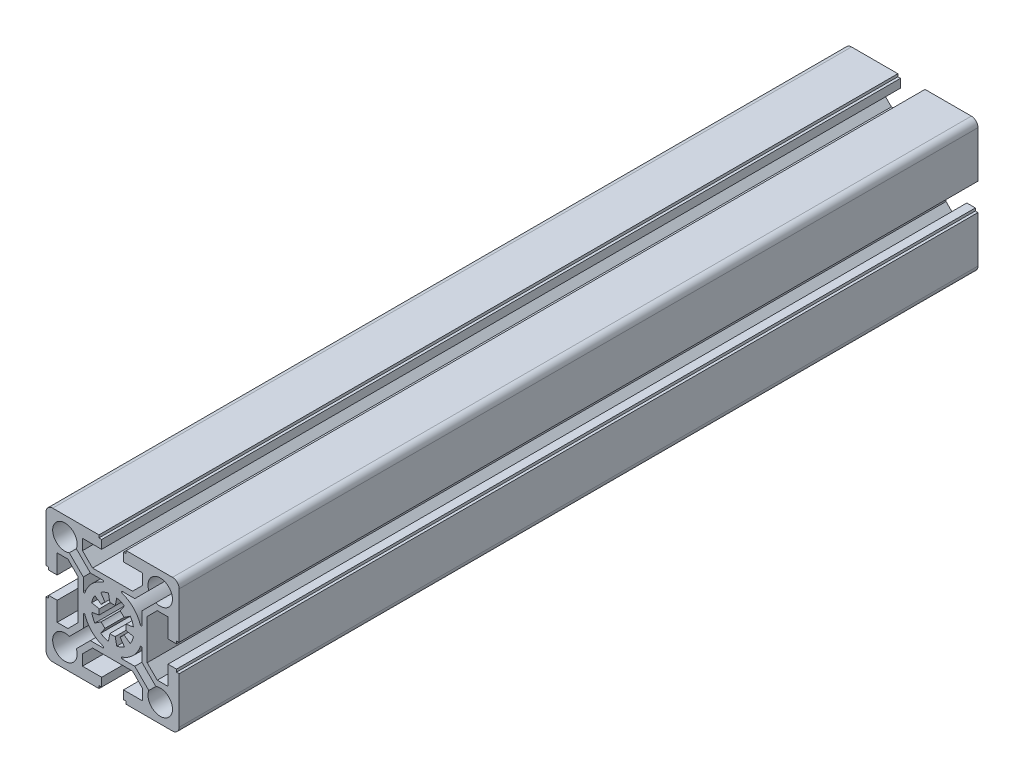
from build123d import *

# Parameters (mm, degrees)
EXTRUDE_1_DEPTH = 150


with BuildPart() as part:
    # Sketch 1 → Extrude 1 (new, symmetric)
    with BuildSketch(Plane.XY):
        with BuildLine():
            Line((-13, 7.519922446), (-13, 0))
            Line((-13, 0), (-13, -7.519922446))
            Line((-13, -7.519922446), (-16.780077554, -11.3))
            Line((-16.780077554, -11.3), (-20.8, -11.3))
            Line((-20.8, -11.3), (-20.8, -4.1))
            Line((-20.8, -4.1), (-24, -4.1))
            Line((-24, -4.1), (-24, -5.1))
            Line((-24, -5.1), (-25, -5.1))
            Line((-25, -5.1), (-25, -22.5))
            ThreePointArc((-25, -22.5), (-24.267766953, -24.267766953), (-22.5, -25))
            Line((-22.5, -25), (-5.1, -25))
            Line((-5.1, -25), (-5.1, -24))
            Line((-5.1, -24), (-4.1, -24))
            Line((-4.1, -24), (-4.1, -20.8))
            Line((-4.1, -20.8), (-11.3, -20.8))
            Line((-11.3, -20.8), (-11.3, -16.780077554))
            Line((-11.3, -16.780077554), (-7.519922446, -13))
            Line((-7.519922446, -13), (0, -13))
            Line((0, -13), (7.519922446, -13))
            Line((7.519922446, -13), (11.3, -16.780077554))
            Line((11.3, -16.780077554), (11.3, -20.8))
            Line((11.3, -20.8), (4.1, -20.8))
            Line((4.1, -20.8), (4.1, -24))
            Line((4.1, -24), (5.1, -24))
            Line((5.1, -24), (5.1, -25))
            Line((5.1, -25), (22.5, -25))
            ThreePointArc((22.5, -25), (24.267766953, -24.267766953), (25, -22.5))
            Line((25, -22.5), (25, -5.1))
            Line((25, -5.1), (24, -5.1))
            Line((24, -5.1), (24, -4.1))
            Line((24, -4.1), (20.8, -4.1))
            Line((20.8, -4.1), (20.8, -11.3))
            Line((20.8, -11.3), (16.780077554, -11.3))
            Line((16.780077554, -11.3), (13, -7.519922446))
            Line((13, -7.519922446), (13, 0))
            Line((13, 0), (13, 7.519922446))
            Line((13, 7.519922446), (16.780077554, 11.3))
            Line((16.780077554, 11.3), (20.8, 11.3))
            Line((20.8, 11.3), (20.8, 4.1))
            Line((20.8, 4.1), (24, 4.1))
            Line((24, 4.1), (24, 5.1))
            Line((24, 5.1), (25, 5.1))
            Line((25, 5.1), (25, 22.5))
            ThreePointArc((25, 22.5), (24.267766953, 24.267766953), (22.5, 25))
            Line((22.5, 25), (5.1, 25))
            Line((5.1, 25), (5.1, 24))
            Line((5.1, 24), (4.1, 24))
            Line((4.1, 24), (4.1, 20.8))
            Line((4.1, 20.8), (11.3, 20.8))
            Line((11.3, 20.8), (11.3, 16.780077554))
            Line((11.3, 16.780077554), (7.519922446, 13))
            Line((7.519922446, 13), (0, 13))
            Line((0, 13), (-7.519922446, 13))
            Line((-7.519922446, 13), (-11.3, 16.780077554))
            Line((-11.3, 16.780077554), (-11.3, 20.8))
            Line((-11.3, 20.8), (-4.1, 20.8))
            Line((-4.1, 20.8), (-4.1, 24))
            Line((-4.1, 24), (-5.1, 24))
            Line((-5.1, 24), (-5.1, 25))
            Line((-5.1, 25), (-22.5, 25))
            ThreePointArc((-22.5, 25), (-24.267766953, 24.267766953), (-25, 22.5))
            Line((-25, 22.5), (-25, 5.1))
            Line((-25, 5.1), (-24, 5.1))
            Line((-24, 5.1), (-24, 4.1))
            Line((-24, 4.1), (-20.8, 4.1))
            Line((-20.8, 4.1), (-20.8, 11.3))
            Line((-20.8, 11.3), (-16.780077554, 11.3))
            Line((-16.780077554, 11.3), (-13, 7.519922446))
        make_face()
        with BuildLine():
            Line((-4.240495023, 2.833408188), (-6.651756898, 4.444561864))
            ThreePointArc((-6.651756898, 4.444561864), (-7.39103626, 3.061467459), (-7.846282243, 1.560722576))
            Line((-7.846282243, 1.560722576), (-5.00200493, 0.994960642))
            ThreePointArc((-5.00200493, 0.994960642), (-5.075442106, 0.499887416), (-5.1, 0))
            ThreePointArc((-5.1, 0), (-5.075442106, -0.499887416), (-5.00200493, -0.994960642))
            Line((-5.00200493, -0.994960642), (-7.846282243, -1.560722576))
            ThreePointArc((-7.846282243, -1.560722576), (-7.39103626, -3.061467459), (-6.651756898, -4.444561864))
            Line((-6.651756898, -4.444561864), (-4.240495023, -2.833408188))
            ThreePointArc((-4.240495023, -2.833408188), (-3.942353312, -3.235405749), (-3.606244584, -3.606244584))
            ThreePointArc((-3.606244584, -3.606244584), (-3.235405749, -3.942353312), (-2.833408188, -4.240495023))
            Line((-2.833408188, -4.240495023), (-4.444561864, -6.651756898))
            ThreePointArc((-4.444561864, -6.651756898), (-3.061467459, -7.39103626), (-1.560722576, -7.846282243))
            Line((-1.560722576, -7.846282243), (-0.994960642, -5.00200493))
            ThreePointArc((-0.994960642, -5.00200493), (-0.499887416, -5.075442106), (0, -5.1))
            ThreePointArc((0, -5.1), (0.499887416, -5.075442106), (0.994960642, -5.00200493))
            Line((0.994960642, -5.00200493), (1.560722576, -7.846282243))
            ThreePointArc((1.560722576, -7.846282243), (3.061467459, -7.39103626), (4.444561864, -6.651756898))
            Line((4.444561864, -6.651756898), (2.833408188, -4.240495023))
            ThreePointArc((2.833408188, -4.240495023), (3.235405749, -3.942353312), (3.606244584, -3.606244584))
            ThreePointArc((3.606244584, -3.606244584), (3.942353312, -3.235405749), (4.240495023, -2.833408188))
            Line((4.240495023, -2.833408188), (6.651756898, -4.444561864))
            ThreePointArc((6.651756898, -4.444561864), (7.39103626, -3.061467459), (7.846282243, -1.560722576))
            Line((7.846282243, -1.560722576), (5.00200493, -0.994960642))
            ThreePointArc((5.00200493, -0.994960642), (5.075442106, -0.499887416), (5.1, 0))
            ThreePointArc((5.1, 0), (5.075442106, 0.499887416), (5.00200493, 0.994960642))
            Line((5.00200493, 0.994960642), (7.846282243, 1.560722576))
            ThreePointArc((7.846282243, 1.560722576), (7.39103626, 3.061467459), (6.651756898, 4.444561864))
            Line((6.651756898, 4.444561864), (4.240495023, 2.833408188))
            ThreePointArc((4.240495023, 2.833408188), (3.942353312, 3.235405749), (3.606244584, 3.606244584))
            ThreePointArc((3.606244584, 3.606244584), (3.235405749, 3.942353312), (2.833408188, 4.240495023))
            Line((2.833408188, 4.240495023), (4.444561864, 6.651756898))
            ThreePointArc((4.444561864, 6.651756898), (3.061467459, 7.39103626), (1.560722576, 7.846282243))
            Line((1.560722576, 7.846282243), (0.994960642, 5.00200493))
            ThreePointArc((0.994960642, 5.00200493), (0.499887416, 5.075442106), (0, 5.1))
            ThreePointArc((0, 5.1), (-0.499887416, 5.075442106), (-0.994960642, 5.00200493))
            Line((-0.994960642, 5.00200493), (-1.560722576, 7.846282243))
            ThreePointArc((-1.560722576, 7.846282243), (-3.061467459, 7.39103626), (-4.444561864, 6.651756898))
            Line((-4.444561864, 6.651756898), (-2.833408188, 4.240495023))
            ThreePointArc((-2.833408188, 4.240495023), (-3.235405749, 3.942353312), (-3.606244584, 3.606244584))
            ThreePointArc((-3.606244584, 3.606244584), (-3.942353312, 3.235405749), (-4.240495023, 2.833408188))
        make_face(mode=Mode.SUBTRACT)
        with BuildLine():
            Line((13.603958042, 16.255608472), (8.348349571, 11))
            Line((8.348349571, 11), (3.633180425, 11))
            ThreePointArc((3.633180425, 11), (3.337189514, 10.74888129), (3.536724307, 10.415929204))
            ThreePointArc((3.536724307, 10.415929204), (7.778174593, 7.778174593), (10.415929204, 3.536724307))
            ThreePointArc((10.415929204, 3.536724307), (10.74888129, 3.337189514), (11, 3.633180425))
            Line((11, 3.633180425), (11, 8.348349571))
            Line((11, 8.348349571), (16.255608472, 13.603958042))
            ThreePointArc((16.255608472, 13.603958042), (21.759080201, 15.396502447), (21.152691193, 21.152691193))
            ThreePointArc((21.152691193, 21.152691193), (15.396502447, 21.759080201), (13.603958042, 16.255608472))
        make_face(mode=Mode.SUBTRACT)
        with BuildLine():
            Line((-16.255608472, 13.603958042), (-11, 8.348349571))
            Line((-11, 8.348349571), (-11, 3.633180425))
            ThreePointArc((-11, 3.633180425), (-10.74888129, 3.337189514), (-10.415929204, 3.536724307))
            ThreePointArc((-10.415929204, 3.536724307), (-7.778174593, 7.778174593), (-3.536724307, 10.415929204))
            ThreePointArc((-3.536724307, 10.415929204), (-3.337189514, 10.74888129), (-3.633180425, 11))
            Line((-3.633180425, 11), (-8.348349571, 11))
            Line((-8.348349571, 11), (-13.603958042, 16.255608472))
            ThreePointArc((-13.603958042, 16.255608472), (-15.396502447, 21.759080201), (-21.152691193, 21.152691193))
            ThreePointArc((-21.152691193, 21.152691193), (-21.759080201, 15.396502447), (-16.255608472, 13.603958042))
        make_face(mode=Mode.SUBTRACT)
        with BuildLine():
            Line((8.348349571, -11), (13.603958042, -16.255608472))
            ThreePointArc((13.603958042, -16.255608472), (15.396502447, -21.759080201), (21.152691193, -21.152691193))
            ThreePointArc((21.152691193, -21.152691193), (21.759080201, -15.396502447), (16.255608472, -13.603958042))
            Line((16.255608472, -13.603958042), (11, -8.348349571))
            Line((11, -8.348349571), (11, -3.633180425))
            ThreePointArc((11, -3.633180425), (10.74888129, -3.337189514), (10.415929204, -3.536724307))
            ThreePointArc((10.415929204, -3.536724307), (7.778174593, -7.778174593), (3.536724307, -10.415929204))
            ThreePointArc((3.536724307, -10.415929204), (3.337189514, -10.74888129), (3.633180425, -11))
            Line((3.633180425, -11), (8.348349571, -11))
        make_face(mode=Mode.SUBTRACT)
        with BuildLine():
            Line((-13.603958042, -16.255608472), (-8.348349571, -11))
            Line((-8.348349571, -11), (-3.633180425, -11))
            ThreePointArc((-3.633180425, -11), (-3.337189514, -10.74888129), (-3.536724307, -10.415929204))
            ThreePointArc((-3.536724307, -10.415929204), (-7.778174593, -7.778174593), (-10.415929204, -3.536724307))
            ThreePointArc((-10.415929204, -3.536724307), (-10.74888129, -3.337189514), (-11, -3.633180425))
            Line((-11, -3.633180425), (-11, -8.348349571))
            Line((-11, -8.348349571), (-16.255608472, -13.603958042))
            ThreePointArc((-16.255608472, -13.603958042), (-21.759080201, -15.396502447), (-21.152691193, -21.152691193))
            ThreePointArc((-21.152691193, -21.152691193), (-15.396502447, -21.759080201), (-13.603958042, -16.255608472))
        make_face(mode=Mode.SUBTRACT)
    extrude(amount=EXTRUDE_1_DEPTH, both=True)


solid = part.part
